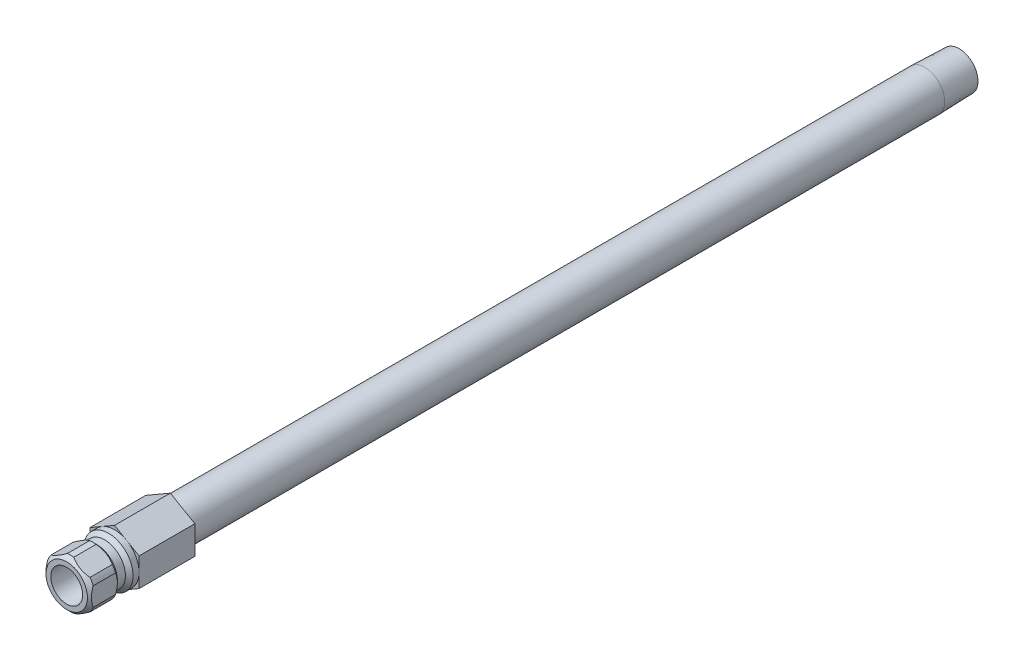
from build123d import *

# Parameters (mm, degrees)
SKETCH2_R           = 2.38125
BOSS_EXTRUDE1_DEPTH = 11.1125
CUT_EXTRUDE1_START  = 3.556
SKETCH3_OUTSIDE_W   = 47.466
SKETCH3_OUTSIDE_H   = 48.978
CUT_EXTRUDE1_DEPTH  = 165.884669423


with BuildPart() as part:
    # Sketch1 → Revolve1 (revolve)
    with BuildSketch(Plane(origin=(0, 0, 0), x_dir=(0, 0, -1), z_dir=(1, 0, 0))):
        Polygon((-9.525, 3.175), (-9.525, 4.1275), (-8.763, 4.8895), (-4.318, 4.8895), (-3.556, 4.1275), (-1.9558, 4.1275), (-1.1938, 4.8895), (0, 4.8895), (0, 3.96875), (161.417, 3.96875), (168.275, 3.754438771), (168.275, 2.38125), (0.127, 2.38125), (0.127, 3.175), align=None)
    revolve(axis=Axis((0, 0, 0), (0, 0, 1)))

    # Sketch2 → Boss-Extrude1 (add)
    with BuildSketch(Plane.XY):
        Polygon((-4.8895, 2.822954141), (-4.8895, -2.822954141), (0, -5.645908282), (4.8895, -2.822954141), (4.8895, 2.822954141), (0, 5.645908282), align=None)
        with Locations(Location((0, 0, 0), (0, 0, 90))):
            Circle(SKETCH2_R, mode=Mode.SUBTRACT)
    extrude(amount=-BOSS_EXTRUDE1_DEPTH)

    # Sketch3 outside → Cut-Extrude1 (cut, through all)
    with BuildSketch(Plane.XY.offset(CUT_EXTRUDE1_START)):
        Rectangle(SKETCH3_OUTSIDE_W, SKETCH3_OUTSIDE_H)
        Polygon((-4.5212, -2.610316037), (0, -5.220632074), (4.5212, -2.610316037), (4.5212, 2.610316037), (0, 5.220632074), (-4.5212, 2.610316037), align=None, mode=Mode.SUBTRACT)
    extrude(amount=CUT_EXTRUDE1_DEPTH, mode=Mode.SUBTRACT)


solid = part.part
